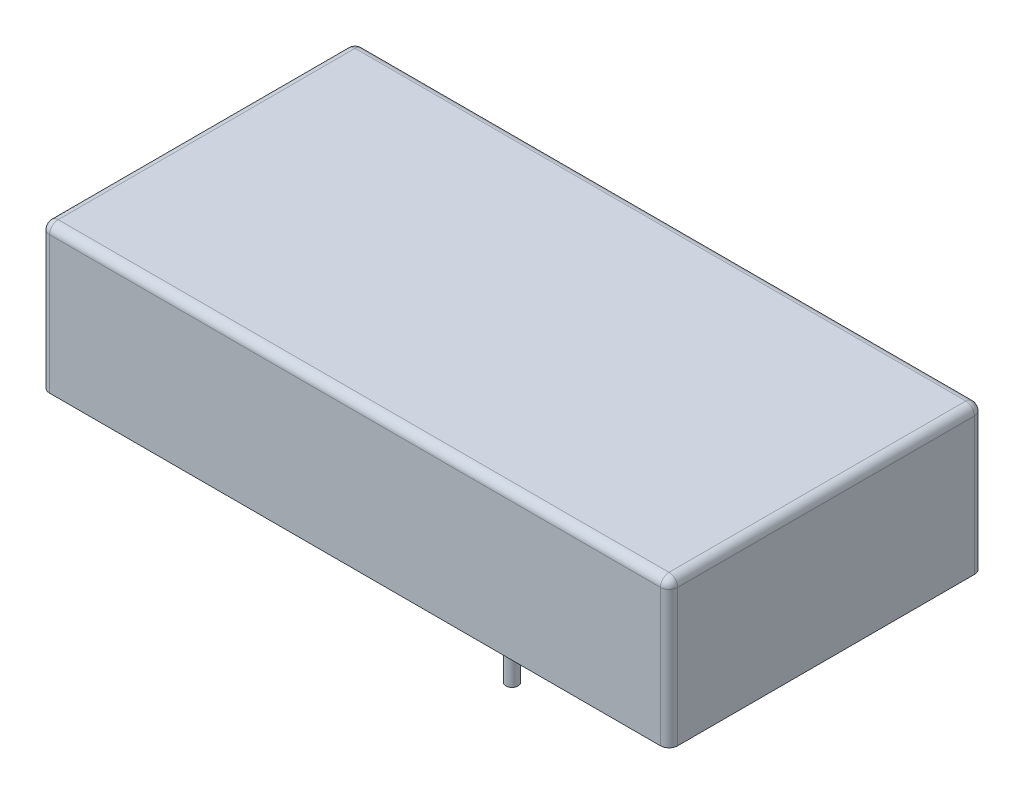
ISO-10303-21;
HEADER;
FILE_DESCRIPTION(('STEP AP214'),'2;1');
FILE_NAME('part.step','',(''),(''),'','','');
FILE_SCHEMA(('AUTOMOTIVE_DESIGN { 1 0 10303 214 1 1 1 1 }'));
ENDSEC;
DATA;
#1=APPLICATION_CONTEXT('core data for automotive mechanical design processes');
#2=APPLICATION_PROTOCOL_DEFINITION('international standard','automotive_design',2000,#1);
#3=PRODUCT_CONTEXT('',#1,'mechanical');
#4=PRODUCT('Part','Part','',(#3));
#5=PRODUCT_RELATED_PRODUCT_CATEGORY('part','',(#4));
#6=PRODUCT_DEFINITION_FORMATION('','',#4);
#7=PRODUCT_DEFINITION_CONTEXT('part definition',#1,'design');
#8=PRODUCT_DEFINITION('design','',#6,#7);
#9=PRODUCT_DEFINITION_SHAPE('','',#8);
#10=(LENGTH_UNIT() NAMED_UNIT(*) SI_UNIT(.MILLI.,.METRE.));
#11=(NAMED_UNIT(*) PLANE_ANGLE_UNIT() SI_UNIT($,.RADIAN.));
#12=(NAMED_UNIT(*) SI_UNIT($,.STERADIAN.) SOLID_ANGLE_UNIT());
#13=UNCERTAINTY_MEASURE_WITH_UNIT(LENGTH_MEASURE(1.E-05),#10,'distance_accuracy_value','');
#14=(GEOMETRIC_REPRESENTATION_CONTEXT(3) GLOBAL_UNCERTAINTY_ASSIGNED_CONTEXT((#13)) GLOBAL_UNIT_ASSIGNED_CONTEXT((#10,
#11,#12)) REPRESENTATION_CONTEXT('',''));
#15=CARTESIAN_POINT('',(0.,0.,0.));
#16=DIRECTION('',(0.,0.,1.));
#17=DIRECTION('',(1.,0.,0.));
#18=AXIS2_PLACEMENT_3D('',#15,#16,#17);
#19=CARTESIAN_POINT('',(10.16,-4.1,-10.16));
#20=DIRECTION('',(0.,1.,0.));
#21=DIRECTION('',(0.,0.,1.));
#22=AXIS2_PLACEMENT_3D('',#19,#20,#21);
#23=CYLINDRICAL_SURFACE('',#22,0.500000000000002);
#24=CARTESIAN_POINT('',(10.16,0.,-10.16));
#25=DIRECTION('',(0.,-1.,0.));
#26=DIRECTION('',(0.,0.,1.));
#27=AXIS2_PLACEMENT_3D('',#24,#25,#26);
#28=CIRCLE('',#27,0.500000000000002);
#29=CARTESIAN_POINT('',(10.16,0.,-9.65999999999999));
#30=VERTEX_POINT('',#29);
#31=EDGE_CURVE('E11',#30,#30,#28,.T.);
#32=ORIENTED_EDGE('',*,*,#31,.T.);
#33=EDGE_LOOP('',(#32));
#34=FACE_BOUND('',#33,.T.);
#35=CARTESIAN_POINT('',(10.16,-4.1,-10.16));
#36=DIRECTION('',(0.,-1.,0.));
#37=DIRECTION('',(0.,0.,-1.));
#38=AXIS2_PLACEMENT_3D('',#35,#36,#37);
#39=CIRCLE('',#38,0.500000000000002);
#40=CARTESIAN_POINT('',(10.16,-4.1,-10.66));
#41=VERTEX_POINT('',#40);
#42=EDGE_CURVE('E232',#41,#41,#39,.T.);
#43=ORIENTED_EDGE('',*,*,#42,.F.);
#44=EDGE_LOOP('',(#43));
#45=FACE_BOUND('',#44,.T.);
#46=ADVANCED_FACE('F17',(#34,#45),#23,.T.);
#47=CARTESIAN_POINT('',(10.16,-4.1,0.));
#48=DIRECTION('',(0.,1.,0.));
#49=DIRECTION('',(0.,0.,1.));
#50=AXIS2_PLACEMENT_3D('',#47,#48,#49);
#51=CYLINDRICAL_SURFACE('',#50,0.500000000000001);
#52=CARTESIAN_POINT('',(10.16,0.,0.));
#53=DIRECTION('',(0.,-1.,0.));
#54=DIRECTION('',(0.,0.,1.));
#55=AXIS2_PLACEMENT_3D('',#52,#53,#54);
#56=CIRCLE('',#55,0.500000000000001);
#57=CARTESIAN_POINT('',(10.16,0.,0.500000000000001));
#58=VERTEX_POINT('',#57);
#59=EDGE_CURVE('E27',#58,#58,#56,.T.);
#60=ORIENTED_EDGE('',*,*,#59,.T.);
#61=EDGE_LOOP('',(#60));
#62=FACE_BOUND('',#61,.T.);
#63=CARTESIAN_POINT('',(10.16,-4.1,0.));
#64=DIRECTION('',(0.,-1.,0.));
#65=DIRECTION('',(0.,0.,-1.));
#66=AXIS2_PLACEMENT_3D('',#63,#64,#65);
#67=CIRCLE('',#66,0.500000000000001);
#68=CARTESIAN_POINT('',(10.16,-4.1,-0.500000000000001));
#69=VERTEX_POINT('',#68);
#70=EDGE_CURVE('E228',#69,#69,#67,.T.);
#71=ORIENTED_EDGE('',*,*,#70,.F.);
#72=EDGE_LOOP('',(#71));
#73=FACE_BOUND('',#72,.T.);
#74=ADVANCED_FACE('F239',(#62,#73),#51,.T.);
#75=CARTESIAN_POINT('',(10.16,-4.1,10.16));
#76=DIRECTION('',(0.,1.,0.));
#77=DIRECTION('',(0.,0.,1.));
#78=AXIS2_PLACEMENT_3D('',#75,#76,#77);
#79=CYLINDRICAL_SURFACE('',#78,0.5);
#80=CARTESIAN_POINT('',(10.16,0.,10.16));
#81=DIRECTION('',(0.,-1.,0.));
#82=DIRECTION('',(0.,0.,1.));
#83=AXIS2_PLACEMENT_3D('',#80,#81,#82);
#84=CIRCLE('',#83,0.5);
#85=CARTESIAN_POINT('',(10.16,0.,10.66));
#86=VERTEX_POINT('',#85);
#87=EDGE_CURVE('E220',#86,#86,#84,.T.);
#88=ORIENTED_EDGE('',*,*,#87,.T.);
#89=EDGE_LOOP('',(#88));
#90=FACE_BOUND('',#89,.T.);
#91=CARTESIAN_POINT('',(10.16,-4.1,10.16));
#92=DIRECTION('',(0.,-1.,0.));
#93=DIRECTION('',(0.,0.,-1.));
#94=AXIS2_PLACEMENT_3D('',#91,#92,#93);
#95=CIRCLE('',#94,0.5);
#96=CARTESIAN_POINT('',(10.16,-4.1,9.66));
#97=VERTEX_POINT('',#96);
#98=EDGE_CURVE('E223',#97,#97,#95,.T.);
#99=ORIENTED_EDGE('',*,*,#98,.F.);
#100=EDGE_LOOP('',(#99));
#101=FACE_BOUND('',#100,.T.);
#102=ADVANCED_FACE('F246',(#90,#101),#79,.T.);
#103=CARTESIAN_POINT('',(-10.16,-4.1,2.54));
#104=DIRECTION('',(0.,1.,0.));
#105=DIRECTION('',(0.,0.,1.));
#106=AXIS2_PLACEMENT_3D('',#103,#104,#105);
#107=CYLINDRICAL_SURFACE('',#106,0.5);
#108=CARTESIAN_POINT('',(-10.16,0.,2.54));
#109=DIRECTION('',(0.,-1.,0.));
#110=DIRECTION('',(0.,0.,1.));
#111=AXIS2_PLACEMENT_3D('',#108,#109,#110);
#112=CIRCLE('',#111,0.5);
#113=CARTESIAN_POINT('',(-10.16,0.,3.04));
#114=VERTEX_POINT('',#113);
#115=EDGE_CURVE('E214',#114,#114,#112,.T.);
#116=ORIENTED_EDGE('',*,*,#115,.T.);
#117=EDGE_LOOP('',(#116));
#118=FACE_BOUND('',#117,.T.);
#119=CARTESIAN_POINT('',(-10.16,-4.1,2.54));
#120=DIRECTION('',(0.,-1.,0.));
#121=DIRECTION('',(0.,0.,-1.));
#122=AXIS2_PLACEMENT_3D('',#119,#120,#121);
#123=CIRCLE('',#122,0.5);
#124=CARTESIAN_POINT('',(-10.16,-4.1,2.04));
#125=VERTEX_POINT('',#124);
#126=EDGE_CURVE('E217',#125,#125,#123,.T.);
#127=ORIENTED_EDGE('',*,*,#126,.F.);
#128=EDGE_LOOP('',(#127));
#129=FACE_BOUND('',#128,.T.);
#130=ADVANCED_FACE('F252',(#118,#129),#107,.T.);
#131=CARTESIAN_POINT('',(-10.16,-4.1,-2.54));
#132=DIRECTION('',(0.,1.,0.));
#133=DIRECTION('',(0.,0.,1.));
#134=AXIS2_PLACEMENT_3D('',#131,#132,#133);
#135=CYLINDRICAL_SURFACE('',#134,0.5);
#136=CARTESIAN_POINT('',(-10.16,0.,-2.54));
#137=DIRECTION('',(0.,-1.,0.));
#138=DIRECTION('',(0.,0.,1.));
#139=AXIS2_PLACEMENT_3D('',#136,#137,#138);
#140=CIRCLE('',#139,0.5);
#141=CARTESIAN_POINT('',(-10.16,0.,-2.04));
#142=VERTEX_POINT('',#141);
#143=EDGE_CURVE('E207',#142,#142,#140,.T.);
#144=ORIENTED_EDGE('',*,*,#143,.T.);
#145=EDGE_LOOP('',(#144));
#146=FACE_BOUND('',#145,.T.);
#147=CARTESIAN_POINT('',(-10.16,-4.1,-2.54));
#148=DIRECTION('',(0.,-1.,0.));
#149=DIRECTION('',(0.,0.,-1.));
#150=AXIS2_PLACEMENT_3D('',#147,#148,#149);
#151=CIRCLE('',#150,0.5);
#152=CARTESIAN_POINT('',(-10.16,-4.1,-3.04));
#153=VERTEX_POINT('',#152);
#154=EDGE_CURVE('E211',#153,#153,#151,.T.);
#155=ORIENTED_EDGE('',*,*,#154,.F.);
#156=EDGE_LOOP('',(#155));
#157=FACE_BOUND('',#156,.T.);
#158=ADVANCED_FACE('F256',(#146,#157),#135,.T.);
#159=CARTESIAN_POINT('',(-10.16,-4.1,-10.16));
#160=DIRECTION('',(0.,1.,0.));
#161=DIRECTION('',(0.,0.,1.));
#162=AXIS2_PLACEMENT_3D('',#159,#160,#161);
#163=CYLINDRICAL_SURFACE('',#162,0.5);
#164=CARTESIAN_POINT('',(-10.16,0.,-10.16));
#165=DIRECTION('',(0.,-1.,0.));
#166=DIRECTION('',(0.,0.,1.));
#167=AXIS2_PLACEMENT_3D('',#164,#165,#166);
#168=CIRCLE('',#167,0.5);
#169=CARTESIAN_POINT('',(-10.16,0.,-9.66));
#170=VERTEX_POINT('',#169);
#171=EDGE_CURVE('E203',#170,#170,#168,.T.);
#172=ORIENTED_EDGE('',*,*,#171,.T.);
#173=EDGE_LOOP('',(#172));
#174=FACE_BOUND('',#173,.T.);
#175=CARTESIAN_POINT('',(-10.16,-4.1,-10.16));
#176=DIRECTION('',(0.,-1.,0.));
#177=DIRECTION('',(0.,0.,-1.));
#178=AXIS2_PLACEMENT_3D('',#175,#176,#177);
#179=CIRCLE('',#178,0.5);
#180=CARTESIAN_POINT('',(-10.16,-4.1,-10.66));
#181=VERTEX_POINT('',#180);
#182=EDGE_CURVE('E208',#181,#181,#179,.T.);
#183=ORIENTED_EDGE('',*,*,#182,.F.);
#184=EDGE_LOOP('',(#183));
#185=FACE_BOUND('',#184,.T.);
#186=ADVANCED_FACE('F260',(#174,#185),#163,.T.);
#187=CARTESIAN_POINT('',(-25.4,0.,12.7));
#188=DIRECTION('',(0.,1.,0.));
#189=DIRECTION('',(0.,0.,1.));
#190=AXIS2_PLACEMENT_3D('',#187,#188,#189);
#191=PLANE('',#190);
#192=ORIENTED_EDGE('',*,*,#59,.F.);
#193=EDGE_LOOP('',(#192));
#194=FACE_BOUND('',#193,.T.);
#195=ORIENTED_EDGE('',*,*,#115,.F.);
#196=EDGE_LOOP('',(#195));
#197=FACE_BOUND('',#196,.T.);
#198=ORIENTED_EDGE('',*,*,#171,.F.);
#199=EDGE_LOOP('',(#198));
#200=FACE_BOUND('',#199,.T.);
#201=DIRECTION('',(0.,0.,1.));
#202=VECTOR('',#201,1.);
#203=CARTESIAN_POINT('',(-25.4,0.,-12.7));
#204=LINE('',#203,#202);
#205=CARTESIAN_POINT('',(-25.4,0.,-12.));
#206=VERTEX_POINT('',#205);
#207=CARTESIAN_POINT('',(-25.4,0.,12.));
#208=VERTEX_POINT('',#207);
#209=EDGE_CURVE('E36',#206,#208,#204,.T.);
#210=ORIENTED_EDGE('',*,*,#209,.F.);
#211=CARTESIAN_POINT('',(-24.7,0.,-12.));
#212=DIRECTION('',(0.,-1.,0.));
#213=DIRECTION('',(0.,0.,1.));
#214=AXIS2_PLACEMENT_3D('',#211,#212,#213);
#215=CIRCLE('',#214,0.699999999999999);
#216=CARTESIAN_POINT('',(-24.7,0.,-12.7));
#217=VERTEX_POINT('',#216);
#218=EDGE_CURVE('E200',#206,#217,#215,.T.);
#219=ORIENTED_EDGE('',*,*,#218,.T.);
#220=DIRECTION('',(-1.,0.,0.));
#221=VECTOR('',#220,1.);
#222=CARTESIAN_POINT('',(-25.4,0.,-12.7));
#223=LINE('',#222,#221);
#224=CARTESIAN_POINT('',(24.7,0.,-12.7));
#225=VERTEX_POINT('',#224);
#226=EDGE_CURVE('E160',#225,#217,#223,.T.);
#227=ORIENTED_EDGE('',*,*,#226,.F.);
#228=CARTESIAN_POINT('',(24.7,0.,-12.));
#229=DIRECTION('',(0.,-1.,0.));
#230=DIRECTION('',(0.,0.,1.));
#231=AXIS2_PLACEMENT_3D('',#228,#229,#230);
#232=CIRCLE('',#231,0.699999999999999);
#233=CARTESIAN_POINT('',(25.4,0.,-12.));
#234=VERTEX_POINT('',#233);
#235=EDGE_CURVE('E196',#225,#234,#232,.T.);
#236=ORIENTED_EDGE('',*,*,#235,.T.);
#237=DIRECTION('',(0.,0.,-1.));
#238=VECTOR('',#237,1.);
#239=CARTESIAN_POINT('',(25.4,0.,-12.7));
#240=LINE('',#239,#238);
#241=CARTESIAN_POINT('',(25.4,0.,12.));
#242=VERTEX_POINT('',#241);
#243=EDGE_CURVE('E170',#242,#234,#240,.T.);
#244=ORIENTED_EDGE('',*,*,#243,.F.);
#245=CARTESIAN_POINT('',(24.7,0.,12.));
#246=DIRECTION('',(0.,-1.,0.));
#247=DIRECTION('',(0.,0.,1.));
#248=AXIS2_PLACEMENT_3D('',#245,#246,#247);
#249=CIRCLE('',#248,0.699999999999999);
#250=CARTESIAN_POINT('',(24.7,0.,12.7));
#251=VERTEX_POINT('',#250);
#252=EDGE_CURVE('E192',#242,#251,#249,.T.);
#253=ORIENTED_EDGE('',*,*,#252,.T.);
#254=DIRECTION('',(1.,0.,0.));
#255=VECTOR('',#254,1.);
#256=CARTESIAN_POINT('',(-25.4,0.,12.7));
#257=LINE('',#256,#255);
#258=CARTESIAN_POINT('',(-24.7,0.,12.7));
#259=VERTEX_POINT('',#258);
#260=EDGE_CURVE('E180',#259,#251,#257,.T.);
#261=ORIENTED_EDGE('',*,*,#260,.F.);
#262=CARTESIAN_POINT('',(-24.7,0.,12.));
#263=DIRECTION('',(0.,-1.,0.));
#264=DIRECTION('',(0.,0.,1.));
#265=AXIS2_PLACEMENT_3D('',#262,#263,#264);
#266=CIRCLE('',#265,0.699999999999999);
#267=EDGE_CURVE('E190',#259,#208,#266,.T.);
#268=ORIENTED_EDGE('',*,*,#267,.T.);
#269=EDGE_LOOP('',(#210,#219,#227,#236,#244,#253,#261,#268));
#270=FACE_BOUND('',#269,.T.);
#271=ORIENTED_EDGE('',*,*,#143,.F.);
#272=EDGE_LOOP('',(#271));
#273=FACE_BOUND('',#272,.T.);
#274=ORIENTED_EDGE('',*,*,#87,.F.);
#275=EDGE_LOOP('',(#274));
#276=FACE_BOUND('',#275,.T.);
#277=ORIENTED_EDGE('',*,*,#31,.F.);
#278=EDGE_LOOP('',(#277));
#279=FACE_BOUND('',#278,.T.);
#280=ADVANCED_FACE('F264',(#194,#197,#200,#270,#273,#276,#279),#191,.F.);
#281=CARTESIAN_POINT('',(-25.4,11.8,-12.7));
#282=DIRECTION('',(1.,0.,0.));
#283=DIRECTION('',(0.,0.,-1.));
#284=AXIS2_PLACEMENT_3D('',#281,#282,#283);
#285=PLANE('',#284);
#286=DIRECTION('',(0.,0.,-1.));
#287=VECTOR('',#286,1.);
#288=CARTESIAN_POINT('',(-25.4,11.1,-12.7));
#289=LINE('',#288,#287);
#290=CARTESIAN_POINT('',(-25.4,11.1,12.));
#291=VERTEX_POINT('',#290);
#292=CARTESIAN_POINT('',(-25.4,11.1,-12.));
#293=VERTEX_POINT('',#292);
#294=EDGE_CURVE('E187',#291,#293,#289,.T.);
#295=ORIENTED_EDGE('',*,*,#294,.T.);
#296=DIRECTION('',(0.,-1.,0.));
#297=VECTOR('',#296,1.);
#298=CARTESIAN_POINT('',(-25.4,11.8,-12.));
#299=LINE('',#298,#297);
#300=EDGE_CURVE('E184',#293,#206,#299,.T.);
#301=ORIENTED_EDGE('',*,*,#300,.T.);
#302=ORIENTED_EDGE('',*,*,#209,.T.);
#303=DIRECTION('',(0.,1.,0.));
#304=VECTOR('',#303,1.);
#305=CARTESIAN_POINT('',(-25.4,11.8,12.));
#306=LINE('',#305,#304);
#307=EDGE_CURVE('E181',#208,#291,#306,.T.);
#308=ORIENTED_EDGE('',*,*,#307,.T.);
#309=EDGE_LOOP('',(#295,#301,#302,#308));
#310=FACE_BOUND('',#309,.T.);
#311=ADVANCED_FACE('F268',(#310),#285,.F.);
#312=CARTESIAN_POINT('',(-25.4,11.8,12.7));
#313=DIRECTION('',(0.,0.,-1.));
#314=DIRECTION('',(-1.,0.,0.));
#315=AXIS2_PLACEMENT_3D('',#312,#313,#314);
#316=PLANE('',#315);
#317=ORIENTED_EDGE('',*,*,#260,.T.);
#318=DIRECTION('',(0.,1.,0.));
#319=VECTOR('',#318,1.);
#320=CARTESIAN_POINT('',(24.7,11.8,12.7));
#321=LINE('',#320,#319);
#322=CARTESIAN_POINT('',(24.7,11.1,12.7));
#323=VERTEX_POINT('',#322);
#324=EDGE_CURVE('E177',#251,#323,#321,.T.);
#325=ORIENTED_EDGE('',*,*,#324,.T.);
#326=DIRECTION('',(-1.,0.,0.));
#327=VECTOR('',#326,1.);
#328=CARTESIAN_POINT('',(-25.4,11.1,12.7));
#329=LINE('',#328,#327);
#330=CARTESIAN_POINT('',(-24.7,11.1,12.7));
#331=VERTEX_POINT('',#330);
#332=EDGE_CURVE('E174',#323,#331,#329,.T.);
#333=ORIENTED_EDGE('',*,*,#332,.T.);
#334=DIRECTION('',(0.,-1.,0.));
#335=VECTOR('',#334,1.);
#336=CARTESIAN_POINT('',(-24.7,11.8,12.7));
#337=LINE('',#336,#335);
#338=EDGE_CURVE('E171',#331,#259,#337,.T.);
#339=ORIENTED_EDGE('',*,*,#338,.T.);
#340=EDGE_LOOP('',(#317,#325,#333,#339));
#341=FACE_BOUND('',#340,.T.);
#342=ADVANCED_FACE('F272',(#341),#316,.F.);
#343=CARTESIAN_POINT('',(25.4,11.8,-12.7));
#344=DIRECTION('',(-1.,0.,0.));
#345=DIRECTION('',(0.,0.,1.));
#346=AXIS2_PLACEMENT_3D('',#343,#344,#345);
#347=PLANE('',#346);
#348=ORIENTED_EDGE('',*,*,#243,.T.);
#349=DIRECTION('',(0.,1.,0.));
#350=VECTOR('',#349,1.);
#351=CARTESIAN_POINT('',(25.4,11.8,-12.));
#352=LINE('',#351,#350);
#353=CARTESIAN_POINT('',(25.4,11.1,-12.));
#354=VERTEX_POINT('',#353);
#355=EDGE_CURVE('E167',#234,#354,#352,.T.);
#356=ORIENTED_EDGE('',*,*,#355,.T.);
#357=DIRECTION('',(0.,0.,1.));
#358=VECTOR('',#357,1.);
#359=CARTESIAN_POINT('',(25.4,11.1,12.7));
#360=LINE('',#359,#358);
#361=CARTESIAN_POINT('',(25.4,11.1,12.));
#362=VERTEX_POINT('',#361);
#363=EDGE_CURVE('E164',#354,#362,#360,.T.);
#364=ORIENTED_EDGE('',*,*,#363,.T.);
#365=DIRECTION('',(0.,-1.,0.));
#366=VECTOR('',#365,1.);
#367=CARTESIAN_POINT('',(25.4,11.8,12.));
#368=LINE('',#367,#366);
#369=EDGE_CURVE('E161',#362,#242,#368,.T.);
#370=ORIENTED_EDGE('',*,*,#369,.T.);
#371=EDGE_LOOP('',(#348,#356,#364,#370));
#372=FACE_BOUND('',#371,.T.);
#373=ADVANCED_FACE('F276',(#372),#347,.F.);
#374=CARTESIAN_POINT('',(-25.4,11.8,-12.7));
#375=DIRECTION('',(0.,0.,1.));
#376=DIRECTION('',(1.,0.,0.));
#377=AXIS2_PLACEMENT_3D('',#374,#375,#376);
#378=PLANE('',#377);
#379=ORIENTED_EDGE('',*,*,#226,.T.);
#380=DIRECTION('',(0.,1.,0.));
#381=VECTOR('',#380,1.);
#382=CARTESIAN_POINT('',(-24.7,11.8,-12.7));
#383=LINE('',#382,#381);
#384=CARTESIAN_POINT('',(-24.7,11.1,-12.7));
#385=VERTEX_POINT('',#384);
#386=EDGE_CURVE('E158',#217,#385,#383,.T.);
#387=ORIENTED_EDGE('',*,*,#386,.T.);
#388=DIRECTION('',(1.,0.,0.));
#389=VECTOR('',#388,1.);
#390=CARTESIAN_POINT('',(25.4,11.1,-12.7));
#391=LINE('',#390,#389);
#392=CARTESIAN_POINT('',(24.7,11.1,-12.7));
#393=VERTEX_POINT('',#392);
#394=EDGE_CURVE('E106',#385,#393,#391,.T.);
#395=ORIENTED_EDGE('',*,*,#394,.T.);
#396=DIRECTION('',(0.,-1.,0.));
#397=VECTOR('',#396,1.);
#398=CARTESIAN_POINT('',(24.7,11.8,-12.7));
#399=LINE('',#398,#397);
#400=EDGE_CURVE('E154',#393,#225,#399,.T.);
#401=ORIENTED_EDGE('',*,*,#400,.T.);
#402=EDGE_LOOP('',(#379,#387,#395,#401));
#403=FACE_BOUND('',#402,.T.);
#404=ADVANCED_FACE('F280',(#403),#378,.F.);
#405=CARTESIAN_POINT('',(-25.4,11.8,12.7));
#406=DIRECTION('',(0.,1.,0.));
#407=DIRECTION('',(0.,0.,1.));
#408=AXIS2_PLACEMENT_3D('',#405,#406,#407);
#409=PLANE('',#408);
#410=DIRECTION('',(1.,0.,0.));
#411=VECTOR('',#410,1.);
#412=CARTESIAN_POINT('',(25.4,11.8,12.));
#413=LINE('',#412,#411);
#414=CARTESIAN_POINT('',(-24.7,11.8,12.));
#415=VERTEX_POINT('',#414);
#416=CARTESIAN_POINT('',(24.7,11.8,12.));
#417=VERTEX_POINT('',#416);
#418=EDGE_CURVE('E152',#415,#417,#413,.T.);
#419=ORIENTED_EDGE('',*,*,#418,.T.);
#420=DIRECTION('',(0.,0.,-1.));
#421=VECTOR('',#420,1.);
#422=CARTESIAN_POINT('',(24.7,11.8,-12.7));
#423=LINE('',#422,#421);
#424=CARTESIAN_POINT('',(24.7,11.8,-12.));
#425=VERTEX_POINT('',#424);
#426=EDGE_CURVE('E128',#417,#425,#423,.T.);
#427=ORIENTED_EDGE('',*,*,#426,.T.);
#428=DIRECTION('',(-1.,0.,0.));
#429=VECTOR('',#428,1.);
#430=CARTESIAN_POINT('',(-25.4,11.8,-12.));
#431=LINE('',#430,#429);
#432=CARTESIAN_POINT('',(-24.7,11.8,-12.));
#433=VERTEX_POINT('',#432);
#434=EDGE_CURVE('E103',#425,#433,#431,.T.);
#435=ORIENTED_EDGE('',*,*,#434,.T.);
#436=DIRECTION('',(0.,0.,1.));
#437=VECTOR('',#436,1.);
#438=CARTESIAN_POINT('',(-24.7,11.8,12.7));
#439=LINE('',#438,#437);
#440=EDGE_CURVE('E116',#433,#415,#439,.T.);
#441=ORIENTED_EDGE('',*,*,#440,.T.);
#442=EDGE_LOOP('',(#419,#427,#435,#441));
#443=FACE_BOUND('',#442,.T.);
#444=ADVANCED_FACE('F127',(#443),#409,.T.);
#445=CARTESIAN_POINT('',(24.7,11.8,12.));
#446=DIRECTION('',(0.,-1.,0.));
#447=DIRECTION('',(0.,0.,-1.));
#448=AXIS2_PLACEMENT_3D('',#445,#446,#447);
#449=CYLINDRICAL_SURFACE('',#448,0.699999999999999);
#450=CARTESIAN_POINT('',(24.7,11.1,12.));
#451=DIRECTION('',(0.,1.,0.));
#452=DIRECTION('',(0.,0.,1.));
#453=AXIS2_PLACEMENT_3D('',#450,#451,#452);
#454=CIRCLE('',#453,0.699999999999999);
#455=EDGE_CURVE('E125',#323,#362,#454,.T.);
#456=ORIENTED_EDGE('',*,*,#455,.F.);
#457=ORIENTED_EDGE('',*,*,#324,.F.);
#458=ORIENTED_EDGE('',*,*,#252,.F.);
#459=ORIENTED_EDGE('',*,*,#369,.F.);
#460=EDGE_LOOP('',(#456,#457,#458,#459));
#461=FACE_BOUND('',#460,.T.);
#462=ADVANCED_FACE('F287',(#461),#449,.T.);
#463=CARTESIAN_POINT('',(24.7,11.1,12.));
#464=DIRECTION('',(0.,1.,0.));
#465=DIRECTION('',(1.,0.,0.));
#466=AXIS2_PLACEMENT_3D('',#463,#464,#465);
#467=SPHERICAL_SURFACE('',#466,0.7);
#468=CARTESIAN_POINT('',(24.7,11.1,12.));
#469=DIRECTION('',(-1.,0.,0.));
#470=DIRECTION('',(0.,0.,-1.));
#471=AXIS2_PLACEMENT_3D('',#468,#469,#470);
#472=CIRCLE('',#471,0.699999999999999);
#473=EDGE_CURVE('E144',#323,#417,#472,.T.);
#474=ORIENTED_EDGE('',*,*,#473,.F.);
#475=ORIENTED_EDGE('',*,*,#455,.T.);
#476=CARTESIAN_POINT('',(24.7,11.1,12.));
#477=DIRECTION('',(0.,0.,-1.));
#478=DIRECTION('',(1.,0.,0.));
#479=AXIS2_PLACEMENT_3D('',#476,#477,#478);
#480=CIRCLE('',#479,0.699999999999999);
#481=EDGE_CURVE('E146',#417,#362,#480,.T.);
#482=ORIENTED_EDGE('',*,*,#481,.F.);
#483=EDGE_LOOP('',(#474,#475,#482));
#484=FACE_BOUND('',#483,.T.);
#485=ADVANCED_FACE('F290',(#484),#467,.T.);
#486=CARTESIAN_POINT('',(24.7,11.8,-12.));
#487=DIRECTION('',(0.,-1.,0.));
#488=DIRECTION('',(0.,0.,-1.));
#489=AXIS2_PLACEMENT_3D('',#486,#487,#488);
#490=CYLINDRICAL_SURFACE('',#489,0.699999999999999);
#491=ORIENTED_EDGE('',*,*,#235,.F.);
#492=ORIENTED_EDGE('',*,*,#400,.F.);
#493=CARTESIAN_POINT('',(24.7,11.1,-12.));
#494=DIRECTION('',(0.,1.,0.));
#495=DIRECTION('',(0.,0.,1.));
#496=AXIS2_PLACEMENT_3D('',#493,#494,#495);
#497=CIRCLE('',#496,0.699999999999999);
#498=EDGE_CURVE('E141',#354,#393,#497,.T.);
#499=ORIENTED_EDGE('',*,*,#498,.F.);
#500=ORIENTED_EDGE('',*,*,#355,.F.);
#501=EDGE_LOOP('',(#491,#492,#499,#500));
#502=FACE_BOUND('',#501,.T.);
#503=ADVANCED_FACE('F294',(#502),#490,.T.);
#504=CARTESIAN_POINT('',(24.7,11.1,12.7));
#505=DIRECTION('',(0.,0.,1.));
#506=DIRECTION('',(1.,0.,0.));
#507=AXIS2_PLACEMENT_3D('',#504,#505,#506);
#508=CYLINDRICAL_SURFACE('',#507,0.699999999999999);
#509=ORIENTED_EDGE('',*,*,#481,.T.);
#510=ORIENTED_EDGE('',*,*,#363,.F.);
#511=CARTESIAN_POINT('',(24.7,11.1,-12.));
#512=DIRECTION('',(0.,0.,-1.));
#513=DIRECTION('',(-1.,0.,0.));
#514=AXIS2_PLACEMENT_3D('',#511,#512,#513);
#515=CIRCLE('',#514,0.699999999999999);
#516=EDGE_CURVE('E93',#425,#354,#515,.T.);
#517=ORIENTED_EDGE('',*,*,#516,.F.);
#518=ORIENTED_EDGE('',*,*,#426,.F.);
#519=EDGE_LOOP('',(#509,#510,#517,#518));
#520=FACE_BOUND('',#519,.T.);
#521=ADVANCED_FACE('F298',(#520),#508,.T.);
#522=CARTESIAN_POINT('',(-25.4,11.1,12.));
#523=DIRECTION('',(-1.,0.,0.));
#524=DIRECTION('',(0.,0.,1.));
#525=AXIS2_PLACEMENT_3D('',#522,#523,#524);
#526=CYLINDRICAL_SURFACE('',#525,0.699999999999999);
#527=ORIENTED_EDGE('',*,*,#473,.T.);
#528=ORIENTED_EDGE('',*,*,#418,.F.);
#529=CARTESIAN_POINT('',(-24.7,11.1,12.));
#530=DIRECTION('',(-1.,0.,0.));
#531=DIRECTION('',(0.,0.,1.));
#532=AXIS2_PLACEMENT_3D('',#529,#530,#531);
#533=CIRCLE('',#532,0.699999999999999);
#534=EDGE_CURVE('E137',#331,#415,#533,.T.);
#535=ORIENTED_EDGE('',*,*,#534,.F.);
#536=ORIENTED_EDGE('',*,*,#332,.F.);
#537=EDGE_LOOP('',(#527,#528,#535,#536));
#538=FACE_BOUND('',#537,.T.);
#539=ADVANCED_FACE('F302',(#538),#526,.T.);
#540=CARTESIAN_POINT('',(-24.7,11.8,12.));
#541=DIRECTION('',(0.,-1.,0.));
#542=DIRECTION('',(0.,0.,-1.));
#543=AXIS2_PLACEMENT_3D('',#540,#541,#542);
#544=CYLINDRICAL_SURFACE('',#543,0.699999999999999);
#545=ORIENTED_EDGE('',*,*,#267,.F.);
#546=ORIENTED_EDGE('',*,*,#338,.F.);
#547=CARTESIAN_POINT('',(-24.7,11.1,12.));
#548=DIRECTION('',(0.,1.,0.));
#549=DIRECTION('',(0.,0.,1.));
#550=AXIS2_PLACEMENT_3D('',#547,#548,#549);
#551=CIRCLE('',#550,0.699999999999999);
#552=EDGE_CURVE('E138',#291,#331,#551,.T.);
#553=ORIENTED_EDGE('',*,*,#552,.F.);
#554=ORIENTED_EDGE('',*,*,#307,.F.);
#555=EDGE_LOOP('',(#545,#546,#553,#554));
#556=FACE_BOUND('',#555,.T.);
#557=ADVANCED_FACE('F305',(#556),#544,.T.);
#558=CARTESIAN_POINT('',(24.7,11.1,-12.));
#559=DIRECTION('',(0.,1.,0.));
#560=DIRECTION('',(1.,0.,0.));
#561=AXIS2_PLACEMENT_3D('',#558,#559,#560);
#562=SPHERICAL_SURFACE('',#561,0.7);
#563=ORIENTED_EDGE('',*,*,#516,.T.);
#564=ORIENTED_EDGE('',*,*,#498,.T.);
#565=CARTESIAN_POINT('',(24.7,11.1,-12.));
#566=DIRECTION('',(-1.,0.,0.));
#567=DIRECTION('',(0.,0.,-1.));
#568=AXIS2_PLACEMENT_3D('',#565,#566,#567);
#569=CIRCLE('',#568,0.699999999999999);
#570=EDGE_CURVE('E133',#425,#393,#569,.T.);
#571=ORIENTED_EDGE('',*,*,#570,.F.);
#572=EDGE_LOOP('',(#563,#564,#571));
#573=FACE_BOUND('',#572,.T.);
#574=ADVANCED_FACE('F309',(#573),#562,.T.);
#575=CARTESIAN_POINT('',(-24.7,11.1,12.));
#576=DIRECTION('',(0.,1.,0.));
#577=DIRECTION('',(1.,0.,0.));
#578=AXIS2_PLACEMENT_3D('',#575,#576,#577);
#579=SPHERICAL_SURFACE('',#578,0.7);
#580=ORIENTED_EDGE('',*,*,#552,.T.);
#581=ORIENTED_EDGE('',*,*,#534,.T.);
#582=CARTESIAN_POINT('',(-24.7,11.1,12.));
#583=DIRECTION('',(0.,0.,-1.));
#584=DIRECTION('',(1.,0.,0.));
#585=AXIS2_PLACEMENT_3D('',#582,#583,#584);
#586=CIRCLE('',#585,0.699999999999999);
#587=EDGE_CURVE('E121',#291,#415,#586,.T.);
#588=ORIENTED_EDGE('',*,*,#587,.F.);
#589=EDGE_LOOP('',(#580,#581,#588));
#590=FACE_BOUND('',#589,.T.);
#591=ADVANCED_FACE('F313',(#590),#579,.T.);
#592=CARTESIAN_POINT('',(-25.4,11.1,-12.));
#593=DIRECTION('',(1.,0.,0.));
#594=DIRECTION('',(0.,0.,-1.));
#595=AXIS2_PLACEMENT_3D('',#592,#593,#594);
#596=CYLINDRICAL_SURFACE('',#595,0.699999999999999);
#597=ORIENTED_EDGE('',*,*,#570,.T.);
#598=ORIENTED_EDGE('',*,*,#394,.F.);
#599=CARTESIAN_POINT('',(-24.7,11.1,-12.));
#600=DIRECTION('',(-1.,0.,0.));
#601=DIRECTION('',(0.,0.,1.));
#602=AXIS2_PLACEMENT_3D('',#599,#600,#601);
#603=CIRCLE('',#602,0.699999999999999);
#604=EDGE_CURVE('E98',#433,#385,#603,.T.);
#605=ORIENTED_EDGE('',*,*,#604,.F.);
#606=ORIENTED_EDGE('',*,*,#434,.F.);
#607=EDGE_LOOP('',(#597,#598,#605,#606));
#608=FACE_BOUND('',#607,.T.);
#609=ADVANCED_FACE('F101',(#608),#596,.T.);
#610=CARTESIAN_POINT('',(-24.7,11.1,12.7));
#611=DIRECTION('',(0.,0.,-1.));
#612=DIRECTION('',(-1.,0.,0.));
#613=AXIS2_PLACEMENT_3D('',#610,#611,#612);
#614=CYLINDRICAL_SURFACE('',#613,0.699999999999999);
#615=ORIENTED_EDGE('',*,*,#587,.T.);
#616=ORIENTED_EDGE('',*,*,#440,.F.);
#617=CARTESIAN_POINT('',(-24.7,11.1,-12.));
#618=DIRECTION('',(0.,0.,-1.));
#619=DIRECTION('',(-1.,0.,0.));
#620=AXIS2_PLACEMENT_3D('',#617,#618,#619);
#621=CIRCLE('',#620,0.699999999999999);
#622=EDGE_CURVE('E111',#293,#433,#621,.T.);
#623=ORIENTED_EDGE('',*,*,#622,.F.);
#624=ORIENTED_EDGE('',*,*,#294,.F.);
#625=EDGE_LOOP('',(#615,#616,#623,#624));
#626=FACE_BOUND('',#625,.T.);
#627=ADVANCED_FACE('F117',(#626),#614,.T.);
#628=CARTESIAN_POINT('',(-24.7,11.1,-12.));
#629=DIRECTION('',(0.,1.,0.));
#630=DIRECTION('',(1.,0.,0.));
#631=AXIS2_PLACEMENT_3D('',#628,#629,#630);
#632=SPHERICAL_SURFACE('',#631,0.7);
#633=ORIENTED_EDGE('',*,*,#622,.T.);
#634=ORIENTED_EDGE('',*,*,#604,.T.);
#635=CARTESIAN_POINT('',(-24.7,11.1,-12.));
#636=DIRECTION('',(0.,-1.,0.));
#637=DIRECTION('',(0.,0.,1.));
#638=AXIS2_PLACEMENT_3D('',#635,#636,#637);
#639=CIRCLE('',#638,0.699999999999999);
#640=EDGE_CURVE('E21',#293,#385,#639,.T.);
#641=ORIENTED_EDGE('',*,*,#640,.F.);
#642=EDGE_LOOP('',(#633,#634,#641));
#643=FACE_BOUND('',#642,.T.);
#644=ADVANCED_FACE('F131',(#643),#632,.T.);
#645=CARTESIAN_POINT('',(-24.7,11.8,-12.));
#646=DIRECTION('',(0.,-1.,0.));
#647=DIRECTION('',(0.,0.,-1.));
#648=AXIS2_PLACEMENT_3D('',#645,#646,#647);
#649=CYLINDRICAL_SURFACE('',#648,0.699999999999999);
#650=ORIENTED_EDGE('',*,*,#640,.T.);
#651=ORIENTED_EDGE('',*,*,#386,.F.);
#652=ORIENTED_EDGE('',*,*,#218,.F.);
#653=ORIENTED_EDGE('',*,*,#300,.F.);
#654=EDGE_LOOP('',(#650,#651,#652,#653));
#655=FACE_BOUND('',#654,.T.);
#656=ADVANCED_FACE('F324',(#655),#649,.T.);
#657=CARTESIAN_POINT('',(-10.16,-4.1,-10.16));
#658=DIRECTION('',(0.,-1.,0.));
#659=DIRECTION('',(0.,0.,-1.));
#660=AXIS2_PLACEMENT_3D('',#657,#658,#659);
#661=PLANE('',#660);
#662=ORIENTED_EDGE('',*,*,#182,.T.);
#663=EDGE_LOOP('',(#662));
#664=FACE_BOUND('',#663,.T.);
#665=ADVANCED_FACE('F327',(#664),#661,.T.);
#666=CARTESIAN_POINT('',(-10.16,-4.1,-2.54));
#667=DIRECTION('',(0.,-1.,0.));
#668=DIRECTION('',(0.,0.,-1.));
#669=AXIS2_PLACEMENT_3D('',#666,#667,#668);
#670=PLANE('',#669);
#671=ORIENTED_EDGE('',*,*,#154,.T.);
#672=EDGE_LOOP('',(#671));
#673=FACE_BOUND('',#672,.T.);
#674=ADVANCED_FACE('F331',(#673),#670,.T.);
#675=CARTESIAN_POINT('',(-10.16,-4.1,2.54));
#676=DIRECTION('',(0.,-1.,0.));
#677=DIRECTION('',(0.,0.,-1.));
#678=AXIS2_PLACEMENT_3D('',#675,#676,#677);
#679=PLANE('',#678);
#680=ORIENTED_EDGE('',*,*,#126,.T.);
#681=EDGE_LOOP('',(#680));
#682=FACE_BOUND('',#681,.T.);
#683=ADVANCED_FACE('F335',(#682),#679,.T.);
#684=CARTESIAN_POINT('',(10.16,-4.1,10.16));
#685=DIRECTION('',(0.,-1.,0.));
#686=DIRECTION('',(0.,0.,-1.));
#687=AXIS2_PLACEMENT_3D('',#684,#685,#686);
#688=PLANE('',#687);
#689=ORIENTED_EDGE('',*,*,#98,.T.);
#690=EDGE_LOOP('',(#689));
#691=FACE_BOUND('',#690,.T.);
#692=ADVANCED_FACE('F339',(#691),#688,.T.);
#693=CARTESIAN_POINT('',(10.16,-4.1,0.));
#694=DIRECTION('',(0.,-1.,0.));
#695=DIRECTION('',(0.,0.,-1.));
#696=AXIS2_PLACEMENT_3D('',#693,#694,#695);
#697=PLANE('',#696);
#698=ORIENTED_EDGE('',*,*,#70,.T.);
#699=EDGE_LOOP('',(#698));
#700=FACE_BOUND('',#699,.T.);
#701=ADVANCED_FACE('F342',(#700),#697,.T.);
#702=CARTESIAN_POINT('',(10.16,-4.1,-10.16));
#703=DIRECTION('',(0.,-1.,0.));
#704=DIRECTION('',(0.,0.,-1.));
#705=AXIS2_PLACEMENT_3D('',#702,#703,#704);
#706=PLANE('',#705);
#707=ORIENTED_EDGE('',*,*,#42,.T.);
#708=EDGE_LOOP('',(#707));
#709=FACE_BOUND('',#708,.T.);
#710=ADVANCED_FACE('F19',(#709),#706,.T.);
#711=CLOSED_SHELL('',(#46,#74,#102,#130,#158,#186,#280,#311,#342,#373,#404,#444,#462,#485,#503,
#521,#539,#557,#574,#591,#609,#627,#644,#656,#665,#674,#683,#692,#701,#710));
#712=MANIFOLD_SOLID_BREP('B1',#711);
#713=ADVANCED_BREP_SHAPE_REPRESENTATION('',(#18,#712),#14);
#714=SHAPE_DEFINITION_REPRESENTATION(#9,#713);
ENDSEC;
END-ISO-10303-21;
